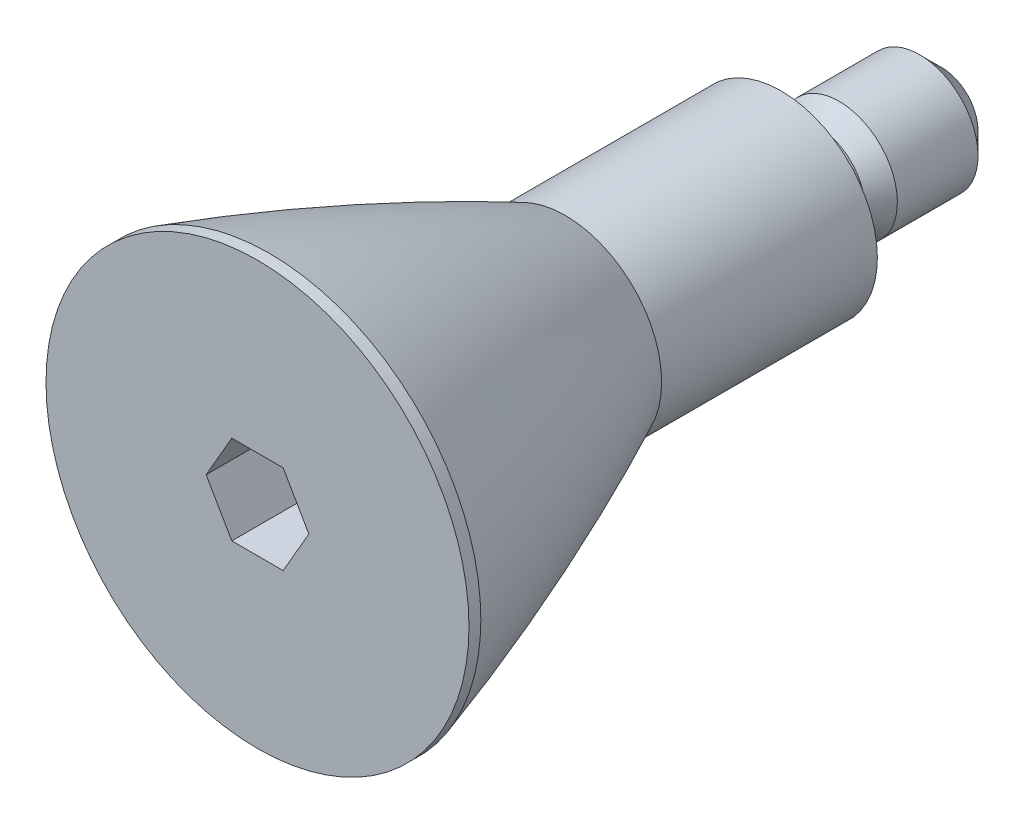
ISO-10303-21;
HEADER;
FILE_DESCRIPTION(('STEP AP214'),'2;1');
FILE_NAME('part.step','',(''),(''),'','','');
FILE_SCHEMA(('AUTOMOTIVE_DESIGN { 1 0 10303 214 1 1 1 1 }'));
ENDSEC;
DATA;
#1=APPLICATION_CONTEXT('core data for automotive mechanical design processes');
#2=APPLICATION_PROTOCOL_DEFINITION('international standard','automotive_design',2000,#1);
#3=PRODUCT_CONTEXT('',#1,'mechanical');
#4=PRODUCT('Part','Part','',(#3));
#5=PRODUCT_RELATED_PRODUCT_CATEGORY('part','',(#4));
#6=PRODUCT_DEFINITION_FORMATION('','',#4);
#7=PRODUCT_DEFINITION_CONTEXT('part definition',#1,'design');
#8=PRODUCT_DEFINITION('design','',#6,#7);
#9=PRODUCT_DEFINITION_SHAPE('','',#8);
#10=(LENGTH_UNIT() NAMED_UNIT(*) SI_UNIT(.MILLI.,.METRE.));
#11=(NAMED_UNIT(*) PLANE_ANGLE_UNIT() SI_UNIT($,.RADIAN.));
#12=(NAMED_UNIT(*) SI_UNIT($,.STERADIAN.) SOLID_ANGLE_UNIT());
#13=UNCERTAINTY_MEASURE_WITH_UNIT(LENGTH_MEASURE(1.E-05),#10,'distance_accuracy_value','');
#14=(GEOMETRIC_REPRESENTATION_CONTEXT(3) GLOBAL_UNCERTAINTY_ASSIGNED_CONTEXT((#13)) GLOBAL_UNIT_ASSIGNED_CONTEXT((#10,
#11,#12)) REPRESENTATION_CONTEXT('',''));
#15=CARTESIAN_POINT('',(0.,0.,0.));
#16=DIRECTION('',(0.,0.,1.));
#17=DIRECTION('',(1.,0.,0.));
#18=AXIS2_PLACEMENT_3D('',#15,#16,#17);
#19=CARTESIAN_POINT('',(0.,-2.76535871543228E-13,79.2030214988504));
#20=DIRECTION('',(0.,0.,1.));
#21=DIRECTION('',(0.,-1.,0.));
#22=AXIS2_PLACEMENT_3D('',#19,#20,#21);
#23=DEGENERATE_TOROIDAL_SURFACE('',#22,128.865654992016,150.,.F.);
#24=CARTESIAN_POINT('',(0.,0.,14.7898526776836));
#25=DIRECTION('',(0.,0.,1.));
#26=DIRECTION('',(0.,-1.,0.));
#27=AXIS2_PLACEMENT_3D('',#24,#25,#26);
#28=CIRCLE('',#27,6.6);
#29=CARTESIAN_POINT('',(0.,-6.60000000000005,14.7898526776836));
#30=VERTEX_POINT('',#29);
#31=EDGE_CURVE('E23',#30,#30,#28,.F.);
#32=ORIENTED_EDGE('',*,*,#31,.F.);
#33=EDGE_LOOP('',(#32));
#34=FACE_BOUND('',#33,.T.);
#35=CARTESIAN_POINT('',(0.,-1.22503009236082E-13,35.0862563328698));
#36=DIRECTION('',(0.,0.,1.));
#37=DIRECTION('',(0.,-1.,0.));
#38=AXIS2_PLACEMENT_3D('',#35,#36,#37);
#39=CIRCLE('',#38,14.5);
#40=CARTESIAN_POINT('',(0.,-14.5000000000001,35.0862563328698));
#41=VERTEX_POINT('',#40);
#42=EDGE_CURVE('E9',#41,#41,#39,.F.);
#43=ORIENTED_EDGE('',*,*,#42,.T.);
#44=EDGE_LOOP('',(#43));
#45=FACE_BOUND('',#44,.T.);
#46=ADVANCED_FACE('F15',(#34,#45),#23,.F.);
#47=CARTESIAN_POINT('',(3.75,0.,0.));
#48=DIRECTION('',(0.,0.,1.));
#49=DIRECTION('',(0.,-1.,0.));
#50=AXIS2_PLACEMENT_3D('',#47,#48,#49);
#51=PLANE('',#50);
#52=CARTESIAN_POINT('',(0.,0.,0.));
#53=DIRECTION('',(0.,0.,1.));
#54=DIRECTION('',(0.,-1.,0.));
#55=AXIS2_PLACEMENT_3D('',#52,#53,#54);
#56=CIRCLE('',#55,3.25);
#57=CARTESIAN_POINT('',(0.,-3.25,0.));
#58=VERTEX_POINT('',#57);
#59=EDGE_CURVE('E138',#58,#58,#56,.F.);
#60=ORIENTED_EDGE('',*,*,#59,.F.);
#61=EDGE_LOOP('',(#60));
#62=FACE_BOUND('',#61,.T.);
#63=CARTESIAN_POINT('',(0.,0.,0.));
#64=DIRECTION('',(0.,0.,1.));
#65=DIRECTION('',(0.,-1.,0.));
#66=AXIS2_PLACEMENT_3D('',#63,#64,#65);
#67=CIRCLE('',#66,6.6);
#68=CARTESIAN_POINT('',(0.,-6.6,0.));
#69=VERTEX_POINT('',#68);
#70=EDGE_CURVE('E131',#69,#69,#67,.T.);
#71=ORIENTED_EDGE('',*,*,#70,.F.);
#72=EDGE_LOOP('',(#71));
#73=FACE_BOUND('',#72,.T.);
#74=ADVANCED_FACE('F149',(#62,#73),#51,.F.);
#75=CARTESIAN_POINT('',(0.,-1.40593215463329E-13,40.2674973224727));
#76=DIRECTION('',(0.,0.,1.));
#77=DIRECTION('',(0.,-1.,0.));
#78=AXIS2_PLACEMENT_3D('',#75,#76,#77);
#79=CYLINDRICAL_SURFACE('',#78,6.6);
#80=ORIENTED_EDGE('',*,*,#70,.T.);
#81=EDGE_LOOP('',(#80));
#82=FACE_BOUND('',#81,.T.);
#83=ORIENTED_EDGE('',*,*,#31,.T.);
#84=EDGE_LOOP('',(#83));
#85=FACE_BOUND('',#84,.T.);
#86=ADVANCED_FACE('F145',(#82,#85),#79,.T.);
#87=CARTESIAN_POINT('',(0.,0.,-11.));
#88=DIRECTION('',(0.,0.,1.));
#89=DIRECTION('',(0.,-1.,0.));
#90=AXIS2_PLACEMENT_3D('',#87,#88,#89);
#91=PLANE('',#90);
#92=CARTESIAN_POINT('',(0.,0.,-11.));
#93=DIRECTION('',(0.,0.,1.));
#94=DIRECTION('',(0.,-1.,0.));
#95=AXIS2_PLACEMENT_3D('',#92,#93,#94);
#96=CIRCLE('',#95,2.5);
#97=CARTESIAN_POINT('',(0.,-2.49999999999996,-11.));
#98=VERTEX_POINT('',#97);
#99=EDGE_CURVE('E135',#98,#98,#96,.F.);
#100=ORIENTED_EDGE('',*,*,#99,.T.);
#101=EDGE_LOOP('',(#100));
#102=FACE_BOUND('',#101,.T.);
#103=ADVANCED_FACE('F189',(#102),#91,.F.);
#104=CARTESIAN_POINT('',(0.,0.,-9.5));
#105=DIRECTION('',(0.,0.,1.));
#106=DIRECTION('',(0.,-1.,0.));
#107=AXIS2_PLACEMENT_3D('',#104,#105,#106);
#108=CONICAL_SURFACE('',#107,4.,0.785398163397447);
#109=ORIENTED_EDGE('',*,*,#99,.F.);
#110=EDGE_LOOP('',(#109));
#111=FACE_BOUND('',#110,.T.);
#112=CARTESIAN_POINT('',(0.,0.,-9.5));
#113=DIRECTION('',(0.,0.,1.));
#114=DIRECTION('',(0.,-1.,0.));
#115=AXIS2_PLACEMENT_3D('',#112,#113,#114);
#116=CIRCLE('',#115,4.);
#117=CARTESIAN_POINT('',(0.,-3.99999999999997,-9.50000000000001));
#118=VERTEX_POINT('',#117);
#119=EDGE_CURVE('E132',#118,#118,#116,.T.);
#120=ORIENTED_EDGE('',*,*,#119,.F.);
#121=EDGE_LOOP('',(#120));
#122=FACE_BOUND('',#121,.T.);
#123=ADVANCED_FACE('F187',(#111,#122),#108,.T.);
#124=CARTESIAN_POINT('',(0.,-1.40593215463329E-13,40.2674973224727));
#125=DIRECTION('',(0.,0.,1.));
#126=DIRECTION('',(0.,-1.,0.));
#127=AXIS2_PLACEMENT_3D('',#124,#125,#126);
#128=CYLINDRICAL_SURFACE('',#127,4.);
#129=ORIENTED_EDGE('',*,*,#119,.T.);
#130=EDGE_LOOP('',(#129));
#131=FACE_BOUND('',#130,.T.);
#132=CARTESIAN_POINT('',(0.,0.,-3.97195787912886));
#133=DIRECTION('',(0.,0.,1.));
#134=DIRECTION('',(0.,-1.,0.));
#135=AXIS2_PLACEMENT_3D('',#132,#133,#134);
#136=CIRCLE('',#135,4.);
#137=CARTESIAN_POINT('',(0.,-3.99999999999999,-3.97195787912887));
#138=VERTEX_POINT('',#137);
#139=EDGE_CURVE('E128',#138,#138,#136,.T.);
#140=ORIENTED_EDGE('',*,*,#139,.F.);
#141=EDGE_LOOP('',(#140));
#142=FACE_BOUND('',#141,.T.);
#143=ADVANCED_FACE('F183',(#131,#142),#128,.T.);
#144=CARTESIAN_POINT('',(0.,0.,-3.97195787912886));
#145=DIRECTION('',(0.,0.,-1.));
#146=DIRECTION('',(0.,1.,0.));
#147=AXIS2_PLACEMENT_3D('',#144,#145,#146);
#148=CONICAL_SURFACE('',#147,4.,0.47123889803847);
#149=CARTESIAN_POINT('',(0.,0.,-2.5));
#150=DIRECTION('',(0.,0.,1.));
#151=DIRECTION('',(0.,-1.,0.));
#152=AXIS2_PLACEMENT_3D('',#149,#150,#151);
#153=CIRCLE('',#152,3.25);
#154=CARTESIAN_POINT('',(0.,-3.24999999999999,-2.50000000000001));
#155=VERTEX_POINT('',#154);
#156=EDGE_CURVE('E125',#155,#155,#153,.T.);
#157=ORIENTED_EDGE('',*,*,#156,.F.);
#158=EDGE_LOOP('',(#157));
#159=FACE_BOUND('',#158,.T.);
#160=ORIENTED_EDGE('',*,*,#139,.T.);
#161=EDGE_LOOP('',(#160));
#162=FACE_BOUND('',#161,.T.);
#163=ADVANCED_FACE('F172',(#159,#162),#148,.T.);
#164=CARTESIAN_POINT('',(0.,-1.40593215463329E-13,40.2674973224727));
#165=DIRECTION('',(0.,0.,1.));
#166=DIRECTION('',(0.,-1.,0.));
#167=AXIS2_PLACEMENT_3D('',#164,#165,#166);
#168=CYLINDRICAL_SURFACE('',#167,3.25);
#169=ORIENTED_EDGE('',*,*,#156,.T.);
#170=EDGE_LOOP('',(#169));
#171=FACE_BOUND('',#170,.T.);
#172=ORIENTED_EDGE('',*,*,#59,.T.);
#173=EDGE_LOOP('',(#172));
#174=FACE_BOUND('',#173,.T.);
#175=ADVANCED_FACE('F164',(#171,#174),#168,.T.);
#176=CARTESIAN_POINT('',(0.,-1.25344180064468E-13,35.9));
#177=DIRECTION('',(0.,0.,-1.));
#178=DIRECTION('',(0.,1.,0.));
#179=AXIS2_PLACEMENT_3D('',#176,#177,#178);
#180=PLANE('',#179);
#181=DIRECTION('',(-1.,0.,0.));
#182=VECTOR('',#181,1.);
#183=CARTESIAN_POINT('',(1.76091832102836,3.04999999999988,35.9));
#184=LINE('',#183,#182);
#185=CARTESIAN_POINT('',(1.76091832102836,3.04999999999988,35.9));
#186=VERTEX_POINT('',#185);
#187=CARTESIAN_POINT('',(-1.76091832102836,3.04999999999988,35.9));
#188=VERTEX_POINT('',#187);
#189=EDGE_CURVE('E104',#186,#188,#184,.T.);
#190=ORIENTED_EDGE('',*,*,#189,.F.);
#191=DIRECTION('',(-0.5,0.866025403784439,0.));
#192=VECTOR('',#191,1.);
#193=CARTESIAN_POINT('',(3.52183664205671,-1.25344180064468E-13,35.9));
#194=LINE('',#193,#192);
#195=CARTESIAN_POINT('',(3.52183664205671,-1.25344180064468E-13,35.9));
#196=VERTEX_POINT('',#195);
#197=EDGE_CURVE('E30',#196,#186,#194,.T.);
#198=ORIENTED_EDGE('',*,*,#197,.F.);
#199=DIRECTION('',(0.5,0.866025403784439,0.));
#200=VECTOR('',#199,1.);
#201=CARTESIAN_POINT('',(1.76091832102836,-3.05000000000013,35.9));
#202=LINE('',#201,#200);
#203=CARTESIAN_POINT('',(1.76091832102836,-3.05000000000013,35.9));
#204=VERTEX_POINT('',#203);
#205=EDGE_CURVE('E113',#204,#196,#202,.T.);
#206=ORIENTED_EDGE('',*,*,#205,.F.);
#207=DIRECTION('',(1.,0.,0.));
#208=VECTOR('',#207,1.);
#209=CARTESIAN_POINT('',(-1.76091832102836,-3.05000000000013,35.9));
#210=LINE('',#209,#208);
#211=CARTESIAN_POINT('',(-1.76091832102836,-3.05000000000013,35.9));
#212=VERTEX_POINT('',#211);
#213=EDGE_CURVE('E111',#212,#204,#210,.T.);
#214=ORIENTED_EDGE('',*,*,#213,.F.);
#215=DIRECTION('',(0.5,-0.866025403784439,0.));
#216=VECTOR('',#215,1.);
#217=CARTESIAN_POINT('',(-3.52183664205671,-1.2805793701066E-13,35.9));
#218=LINE('',#217,#216);
#219=CARTESIAN_POINT('',(-3.52183664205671,-1.2805793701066E-13,35.9));
#220=VERTEX_POINT('',#219);
#221=EDGE_CURVE('E78',#220,#212,#218,.T.);
#222=ORIENTED_EDGE('',*,*,#221,.F.);
#223=DIRECTION('',(-0.5,-0.866025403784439,0.));
#224=VECTOR('',#223,1.);
#225=CARTESIAN_POINT('',(-1.76091832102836,3.04999999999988,35.9));
#226=LINE('',#225,#224);
#227=EDGE_CURVE('E107',#188,#220,#226,.T.);
#228=ORIENTED_EDGE('',*,*,#227,.F.);
#229=EDGE_LOOP('',(#190,#198,#206,#214,#222,#228));
#230=FACE_BOUND('',#229,.T.);
#231=CARTESIAN_POINT('',(0.,-1.25344180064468E-13,35.9));
#232=DIRECTION('',(0.,0.,1.));
#233=DIRECTION('',(0.,-1.,0.));
#234=AXIS2_PLACEMENT_3D('',#231,#232,#233);
#235=CIRCLE('',#234,14.5);
#236=CARTESIAN_POINT('',(0.,-14.5000000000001,35.9));
#237=VERTEX_POINT('',#236);
#238=EDGE_CURVE('E117',#237,#237,#235,.T.);
#239=ORIENTED_EDGE('',*,*,#238,.T.);
#240=EDGE_LOOP('',(#239));
#241=FACE_BOUND('',#240,.T.);
#242=ADVANCED_FACE('F155',(#230,#241),#180,.F.);
#243=CARTESIAN_POINT('',(0.,-1.40593215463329E-13,40.2674973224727));
#244=DIRECTION('',(0.,0.,1.));
#245=DIRECTION('',(0.,-1.,0.));
#246=AXIS2_PLACEMENT_3D('',#243,#244,#245);
#247=CYLINDRICAL_SURFACE('',#246,14.5);
#248=ORIENTED_EDGE('',*,*,#238,.F.);
#249=EDGE_LOOP('',(#248));
#250=FACE_BOUND('',#249,.T.);
#251=ORIENTED_EDGE('',*,*,#42,.F.);
#252=EDGE_LOOP('',(#251));
#253=FACE_BOUND('',#252,.T.);
#254=ADVANCED_FACE('F17',(#250,#253),#247,.T.);
#255=CARTESIAN_POINT('',(3.52183664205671,-1.07886773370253E-13,30.9));
#256=DIRECTION('',(0.866025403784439,0.5,0.));
#257=DIRECTION('',(-0.5,0.866025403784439,0.));
#258=AXIS2_PLACEMENT_3D('',#255,#256,#257);
#259=PLANE('',#258);
#260=ORIENTED_EDGE('',*,*,#197,.T.);
#261=DIRECTION('',(0.,0.,1.));
#262=VECTOR('',#261,1.);
#263=CARTESIAN_POINT('',(1.76091832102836,3.04999999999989,30.9));
#264=LINE('',#263,#262);
#265=CARTESIAN_POINT('',(1.76091832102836,3.04999999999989,30.9));
#266=VERTEX_POINT('',#265);
#267=EDGE_CURVE('E60',#266,#186,#264,.T.);
#268=ORIENTED_EDGE('',*,*,#267,.F.);
#269=DIRECTION('',(-0.5,0.866025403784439,0.));
#270=VECTOR('',#269,1.);
#271=CARTESIAN_POINT('',(3.52183664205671,-1.07886773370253E-13,30.9));
#272=LINE('',#271,#270);
#273=CARTESIAN_POINT('',(3.52183664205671,-1.07886773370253E-13,30.9));
#274=VERTEX_POINT('',#273);
#275=EDGE_CURVE('E115',#274,#266,#272,.T.);
#276=ORIENTED_EDGE('',*,*,#275,.F.);
#277=DIRECTION('',(0.,0.,1.));
#278=VECTOR('',#277,1.);
#279=CARTESIAN_POINT('',(3.52183664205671,-1.07886773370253E-13,30.9));
#280=LINE('',#279,#278);
#281=EDGE_CURVE('E38',#274,#196,#280,.T.);
#282=ORIENTED_EDGE('',*,*,#281,.T.);
#283=EDGE_LOOP('',(#260,#268,#276,#282));
#284=FACE_BOUND('',#283,.T.);
#285=ADVANCED_FACE('F154',(#284),#259,.F.);
#286=CARTESIAN_POINT('',(1.76091832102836,-3.05000000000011,30.9));
#287=DIRECTION('',(0.866025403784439,-0.5,0.));
#288=DIRECTION('',(0.5,0.866025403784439,0.));
#289=AXIS2_PLACEMENT_3D('',#286,#287,#288);
#290=PLANE('',#289);
#291=ORIENTED_EDGE('',*,*,#205,.T.);
#292=ORIENTED_EDGE('',*,*,#281,.F.);
#293=DIRECTION('',(0.5,0.866025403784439,0.));
#294=VECTOR('',#293,1.);
#295=CARTESIAN_POINT('',(1.76091832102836,-3.05000000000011,30.9));
#296=LINE('',#295,#294);
#297=CARTESIAN_POINT('',(1.76091832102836,-3.05000000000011,30.9));
#298=VERTEX_POINT('',#297);
#299=EDGE_CURVE('E90',#298,#274,#296,.T.);
#300=ORIENTED_EDGE('',*,*,#299,.F.);
#301=DIRECTION('',(0.,0.,1.));
#302=VECTOR('',#301,1.);
#303=CARTESIAN_POINT('',(1.76091832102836,-3.05000000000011,30.9));
#304=LINE('',#303,#302);
#305=EDGE_CURVE('E82',#298,#204,#304,.T.);
#306=ORIENTED_EDGE('',*,*,#305,.T.);
#307=EDGE_LOOP('',(#291,#292,#300,#306));
#308=FACE_BOUND('',#307,.T.);
#309=ADVANCED_FACE('F162',(#308),#290,.F.);
#310=CARTESIAN_POINT('',(-1.76091832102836,-3.05000000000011,30.9));
#311=DIRECTION('',(0.,-1.,0.));
#312=DIRECTION('',(1.,0.,0.));
#313=AXIS2_PLACEMENT_3D('',#310,#311,#312);
#314=PLANE('',#313);
#315=ORIENTED_EDGE('',*,*,#213,.T.);
#316=ORIENTED_EDGE('',*,*,#305,.F.);
#317=DIRECTION('',(1.,0.,0.));
#318=VECTOR('',#317,1.);
#319=CARTESIAN_POINT('',(-1.76091832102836,-3.05000000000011,30.9));
#320=LINE('',#319,#318);
#321=CARTESIAN_POINT('',(-1.76091832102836,-3.05000000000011,30.9));
#322=VERTEX_POINT('',#321);
#323=EDGE_CURVE('E86',#322,#298,#320,.T.);
#324=ORIENTED_EDGE('',*,*,#323,.F.);
#325=DIRECTION('',(0.,0.,1.));
#326=VECTOR('',#325,1.);
#327=CARTESIAN_POINT('',(-1.76091832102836,-3.05000000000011,30.9));
#328=LINE('',#327,#326);
#329=EDGE_CURVE('E71',#322,#212,#328,.T.);
#330=ORIENTED_EDGE('',*,*,#329,.T.);
#331=EDGE_LOOP('',(#315,#316,#324,#330));
#332=FACE_BOUND('',#331,.T.);
#333=ADVANCED_FACE('F87',(#332),#314,.F.);
#334=CARTESIAN_POINT('',(-3.52183664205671,-1.10600530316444E-13,30.9));
#335=DIRECTION('',(-0.866025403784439,-0.5,0.));
#336=DIRECTION('',(0.5,-0.866025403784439,0.));
#337=AXIS2_PLACEMENT_3D('',#334,#335,#336);
#338=PLANE('',#337);
#339=ORIENTED_EDGE('',*,*,#221,.T.);
#340=ORIENTED_EDGE('',*,*,#329,.F.);
#341=DIRECTION('',(0.5,-0.866025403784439,0.));
#342=VECTOR('',#341,1.);
#343=CARTESIAN_POINT('',(-3.52183664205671,-1.10600530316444E-13,30.9));
#344=LINE('',#343,#342);
#345=CARTESIAN_POINT('',(-3.52183664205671,-1.10600530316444E-13,30.9));
#346=VERTEX_POINT('',#345);
#347=EDGE_CURVE('E75',#346,#322,#344,.T.);
#348=ORIENTED_EDGE('',*,*,#347,.F.);
#349=DIRECTION('',(0.,0.,1.));
#350=VECTOR('',#349,1.);
#351=CARTESIAN_POINT('',(-3.52183664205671,-1.10600530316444E-13,30.9));
#352=LINE('',#351,#350);
#353=EDGE_CURVE('E83',#346,#220,#352,.T.);
#354=ORIENTED_EDGE('',*,*,#353,.T.);
#355=EDGE_LOOP('',(#339,#340,#348,#354));
#356=FACE_BOUND('',#355,.T.);
#357=ADVANCED_FACE('F73',(#356),#338,.F.);
#358=CARTESIAN_POINT('',(-1.76091832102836,3.04999999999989,30.9));
#359=DIRECTION('',(-0.866025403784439,0.5,0.));
#360=DIRECTION('',(-0.5,-0.866025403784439,0.));
#361=AXIS2_PLACEMENT_3D('',#358,#359,#360);
#362=PLANE('',#361);
#363=ORIENTED_EDGE('',*,*,#227,.T.);
#364=ORIENTED_EDGE('',*,*,#353,.F.);
#365=DIRECTION('',(-0.5,-0.866025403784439,0.));
#366=VECTOR('',#365,1.);
#367=CARTESIAN_POINT('',(-1.76091832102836,3.04999999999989,30.9));
#368=LINE('',#367,#366);
#369=CARTESIAN_POINT('',(-1.76091832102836,3.04999999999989,30.9));
#370=VERTEX_POINT('',#369);
#371=EDGE_CURVE('E96',#370,#346,#368,.T.);
#372=ORIENTED_EDGE('',*,*,#371,.F.);
#373=DIRECTION('',(0.,0.,1.));
#374=VECTOR('',#373,1.);
#375=CARTESIAN_POINT('',(-1.76091832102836,3.04999999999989,30.9));
#376=LINE('',#375,#374);
#377=EDGE_CURVE('E120',#370,#188,#376,.T.);
#378=ORIENTED_EDGE('',*,*,#377,.T.);
#379=EDGE_LOOP('',(#363,#364,#372,#378));
#380=FACE_BOUND('',#379,.T.);
#381=ADVANCED_FACE('F276',(#380),#362,.F.);
#382=CARTESIAN_POINT('',(1.76091832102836,3.04999999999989,30.9));
#383=DIRECTION('',(0.,1.,0.));
#384=DIRECTION('',(-1.,0.,0.));
#385=AXIS2_PLACEMENT_3D('',#382,#383,#384);
#386=PLANE('',#385);
#387=ORIENTED_EDGE('',*,*,#189,.T.);
#388=ORIENTED_EDGE('',*,*,#377,.F.);
#389=DIRECTION('',(-1.,0.,0.));
#390=VECTOR('',#389,1.);
#391=CARTESIAN_POINT('',(1.76091832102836,3.04999999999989,30.9));
#392=LINE('',#391,#390);
#393=EDGE_CURVE('E98',#266,#370,#392,.T.);
#394=ORIENTED_EDGE('',*,*,#393,.F.);
#395=ORIENTED_EDGE('',*,*,#267,.T.);
#396=EDGE_LOOP('',(#387,#388,#394,#395));
#397=FACE_BOUND('',#396,.T.);
#398=ADVANCED_FACE('F285',(#397),#386,.F.);
#399=CARTESIAN_POINT('',(1.76091832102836,3.04999999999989,30.9));
#400=DIRECTION('',(0.,0.,1.));
#401=DIRECTION('',(0.,-1.,0.));
#402=AXIS2_PLACEMENT_3D('',#399,#400,#401);
#403=PLANE('',#402);
#404=ORIENTED_EDGE('',*,*,#275,.T.);
#405=ORIENTED_EDGE('',*,*,#393,.T.);
#406=ORIENTED_EDGE('',*,*,#371,.T.);
#407=ORIENTED_EDGE('',*,*,#347,.T.);
#408=ORIENTED_EDGE('',*,*,#323,.T.);
#409=ORIENTED_EDGE('',*,*,#299,.T.);
#410=EDGE_LOOP('',(#404,#405,#406,#407,#408,#409));
#411=FACE_BOUND('',#410,.T.);
#412=ADVANCED_FACE('F93',(#411),#403,.T.);
#413=CLOSED_SHELL('',(#46,#74,#86,#103,#123,#143,#163,#175,#242,#254,#285,#309,#333,#357,#381,
#398,#412));
#414=MANIFOLD_SOLID_BREP('B1',#413);
#415=ADVANCED_BREP_SHAPE_REPRESENTATION('',(#18,#414),#14);
#416=SHAPE_DEFINITION_REPRESENTATION(#9,#415);
ENDSEC;
END-ISO-10303-21;
